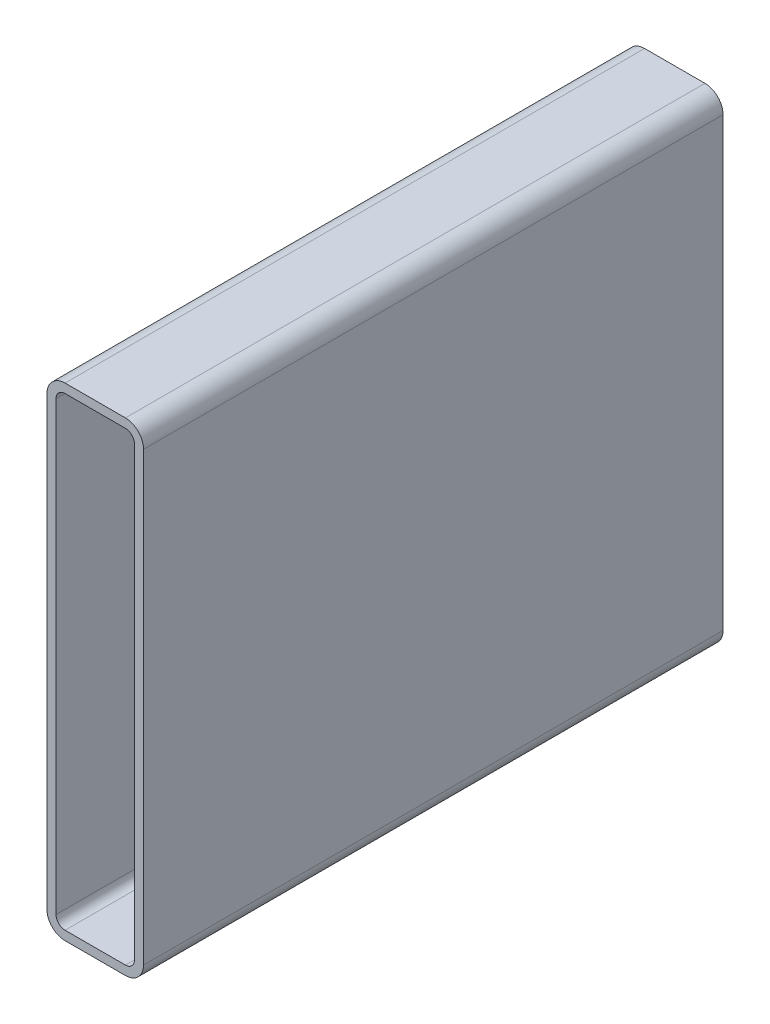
from build123d import *

# Parameters (mm, degrees)
BOSS_EXTRUDE1_DEPTH = 304.8


with BuildPart() as part:
    # Sketch1 → Boss-Extrude1 (new body)
    with BuildSketch(Plane.XY):
        with BuildLine():
            Line((9.525, 254), (41.275, 254))
            ThreePointArc((41.275, 254), (48.010192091, 251.210192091), (50.8, 244.475))
            Line((50.8, 244.475), (50.8, 9.525))
            ThreePointArc((50.8, 9.525), (48.010192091, 2.789807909), (41.275, 0))
            Line((41.275, 0), (9.525, 0))
            ThreePointArc((9.525, 0), (2.789807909, 2.789807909), (0, 9.525))
            Line((0, 9.525), (0, 244.475))
            ThreePointArc((0, 244.475), (2.789807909, 251.210192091), (9.525, 254))
        make_face()
        with BuildLine():
            Line((9.525, 249.2375), (41.275, 249.2375))
            ThreePointArc((41.275, 249.2375), (44.642596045, 247.842596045), (46.0375, 244.475))
            Line((46.0375, 244.475), (46.0375, 9.525))
            ThreePointArc((46.0375, 9.525), (44.642596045, 6.157403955), (41.275, 4.7625))
            Line((41.275, 4.7625), (9.525, 4.7625))
            ThreePointArc((9.525, 4.7625), (6.157403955, 6.157403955), (4.7625, 9.525))
            Line((4.7625, 9.525), (4.7625, 244.475))
            ThreePointArc((4.7625, 244.475), (6.157403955, 247.842596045), (9.525, 249.2375))
        make_face(mode=Mode.SUBTRACT)
    extrude(amount=BOSS_EXTRUDE1_DEPTH)


solid = part.part
